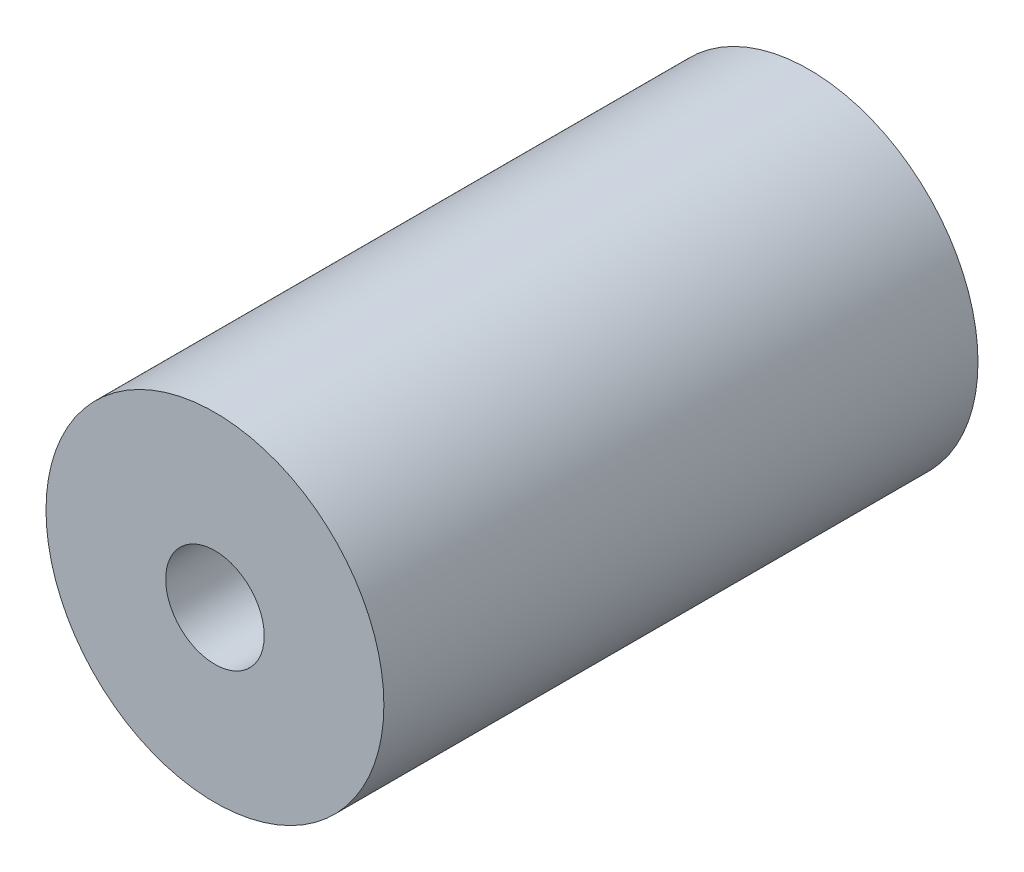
from build123d import *

# Parameters (mm, degrees)
ESQUISSE1_R        = 6
ESQUISSE1_R_2      = 1.75
BOSS_EXTRU_1_DEPTH = 21.1


with BuildPart() as part:
    # Esquisse1 → Boss.-Extru.1 (new body)
    with BuildSketch(Plane.XY):
        Circle(ESQUISSE1_R)
        Circle(ESQUISSE1_R_2, mode=Mode.SUBTRACT)
    extrude(amount=BOSS_EXTRU_1_DEPTH)


solid = part.part
